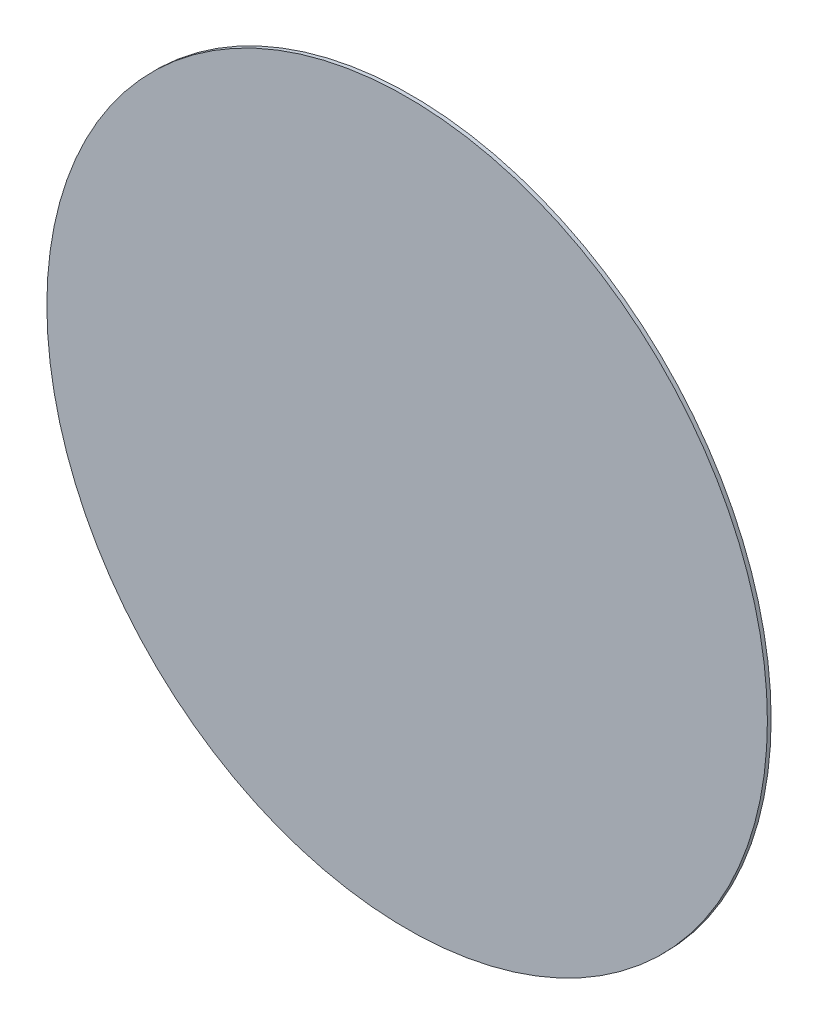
from build123d import *

# Parameters (mm, degrees)
SKETCH1_R      = 12.5
EXTRUDE1_DEPTH = 0.13


with BuildPart() as part:
    # Sketch1 → Extrude1 (new body)
    with BuildSketch(Plane.XY):
        Circle(SKETCH1_R)
    extrude(amount=EXTRUDE1_DEPTH)


solid = part.part
